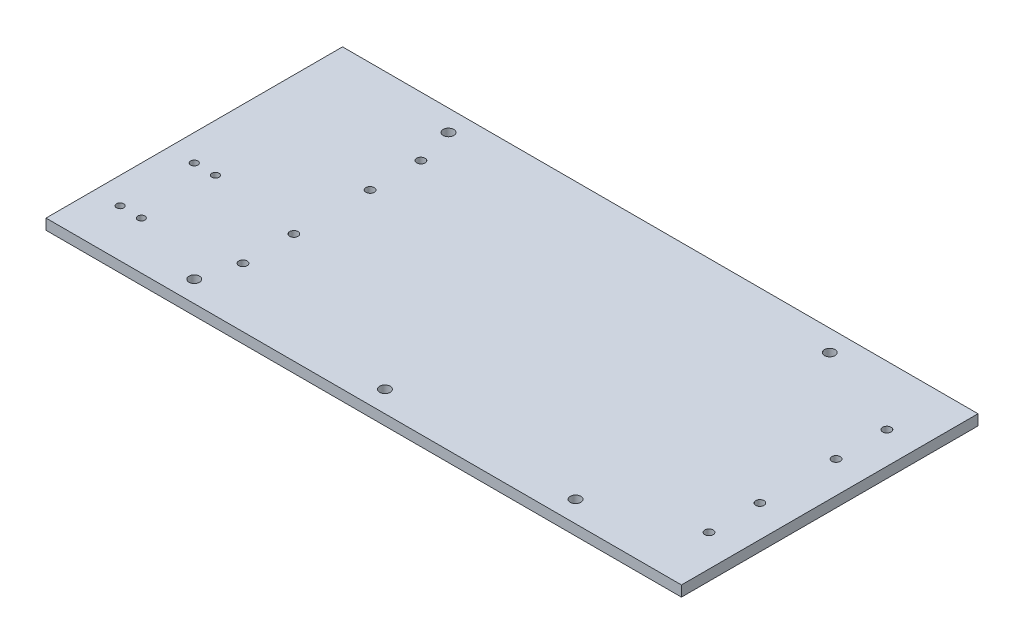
ISO-10303-21;
HEADER;
FILE_DESCRIPTION(('STEP AP214'),'2;1');
FILE_NAME('part.step','',(''),(''),'','','');
FILE_SCHEMA(('AUTOMOTIVE_DESIGN { 1 0 10303 214 1 1 1 1 }'));
ENDSEC;
DATA;
#1=APPLICATION_CONTEXT('core data for automotive mechanical design processes');
#2=APPLICATION_PROTOCOL_DEFINITION('international standard','automotive_design',2000,#1);
#3=PRODUCT_CONTEXT('',#1,'mechanical');
#4=PRODUCT('Part','Part','',(#3));
#5=PRODUCT_RELATED_PRODUCT_CATEGORY('part','',(#4));
#6=PRODUCT_DEFINITION_FORMATION('','',#4);
#7=PRODUCT_DEFINITION_CONTEXT('part definition',#1,'design');
#8=PRODUCT_DEFINITION('design','',#6,#7);
#9=PRODUCT_DEFINITION_SHAPE('','',#8);
#10=(LENGTH_UNIT() NAMED_UNIT(*) SI_UNIT(.MILLI.,.METRE.));
#11=(NAMED_UNIT(*) PLANE_ANGLE_UNIT() SI_UNIT($,.RADIAN.));
#12=(NAMED_UNIT(*) SI_UNIT($,.STERADIAN.) SOLID_ANGLE_UNIT());
#13=UNCERTAINTY_MEASURE_WITH_UNIT(LENGTH_MEASURE(1.E-05),#10,'distance_accuracy_value','');
#14=(GEOMETRIC_REPRESENTATION_CONTEXT(3) GLOBAL_UNCERTAINTY_ASSIGNED_CONTEXT((#13)) GLOBAL_UNIT_ASSIGNED_CONTEXT((#10,
#11,#12)) REPRESENTATION_CONTEXT('',''));
#15=CARTESIAN_POINT('',(0.,0.,0.));
#16=DIRECTION('',(0.,0.,1.));
#17=DIRECTION('',(1.,0.,0.));
#18=AXIS2_PLACEMENT_3D('',#15,#16,#17);
#19=CARTESIAN_POINT('',(-190.5,6.35,88.9));
#20=DIRECTION('',(1.,0.,0.));
#21=DIRECTION('',(0.,0.,-1.));
#22=AXIS2_PLACEMENT_3D('',#19,#20,#21);
#23=PLANE('',#22);
#24=DIRECTION('',(0.,0.,1.));
#25=VECTOR('',#24,1.);
#26=CARTESIAN_POINT('',(-190.5,0.,88.9));
#27=LINE('',#26,#25);
#28=CARTESIAN_POINT('',(-190.5,0.,-88.9));
#29=VERTEX_POINT('',#28);
#30=CARTESIAN_POINT('',(-190.5,0.,88.9));
#31=VERTEX_POINT('',#30);
#32=EDGE_CURVE('E106',#29,#31,#27,.T.);
#33=ORIENTED_EDGE('',*,*,#32,.T.);
#34=DIRECTION('',(0.,-1.,0.));
#35=VECTOR('',#34,1.);
#36=CARTESIAN_POINT('',(-190.5,6.35,88.9));
#37=LINE('',#36,#35);
#38=CARTESIAN_POINT('',(-190.5,6.35,88.9));
#39=VERTEX_POINT('',#38);
#40=EDGE_CURVE('E11',#39,#31,#37,.T.);
#41=ORIENTED_EDGE('',*,*,#40,.F.);
#42=DIRECTION('',(0.,0.,1.));
#43=VECTOR('',#42,1.);
#44=CARTESIAN_POINT('',(-190.5,6.35,88.9));
#45=LINE('',#44,#43);
#46=CARTESIAN_POINT('',(-190.5,6.35,-88.9));
#47=VERTEX_POINT('',#46);
#48=EDGE_CURVE('E90',#47,#39,#45,.T.);
#49=ORIENTED_EDGE('',*,*,#48,.F.);
#50=DIRECTION('',(0.,-1.,0.));
#51=VECTOR('',#50,1.);
#52=CARTESIAN_POINT('',(-190.5,6.35,-88.9));
#53=LINE('',#52,#51);
#54=EDGE_CURVE('E102',#47,#29,#53,.T.);
#55=ORIENTED_EDGE('',*,*,#54,.T.);
#56=EDGE_LOOP('',(#33,#41,#49,#55));
#57=FACE_BOUND('',#56,.T.);
#58=ADVANCED_FACE('F38',(#57),#23,.F.);
#59=CARTESIAN_POINT('',(-190.5,6.35,88.9));
#60=DIRECTION('',(0.,0.,-1.));
#61=DIRECTION('',(-1.,0.,0.));
#62=AXIS2_PLACEMENT_3D('',#59,#60,#61);
#63=PLANE('',#62);
#64=DIRECTION('',(1.,0.,0.));
#65=VECTOR('',#64,1.);
#66=CARTESIAN_POINT('',(-190.5,0.,88.9));
#67=LINE('',#66,#65);
#68=CARTESIAN_POINT('',(190.5,0.,88.9));
#69=VERTEX_POINT('',#68);
#70=EDGE_CURVE('E95',#31,#69,#67,.T.);
#71=ORIENTED_EDGE('',*,*,#70,.T.);
#72=DIRECTION('',(0.,-1.,0.));
#73=VECTOR('',#72,1.);
#74=CARTESIAN_POINT('',(190.5,6.35,88.9));
#75=LINE('',#74,#73);
#76=CARTESIAN_POINT('',(190.5,6.35,88.9));
#77=VERTEX_POINT('',#76);
#78=EDGE_CURVE('E47',#77,#69,#75,.T.);
#79=ORIENTED_EDGE('',*,*,#78,.F.);
#80=DIRECTION('',(1.,0.,0.));
#81=VECTOR('',#80,1.);
#82=CARTESIAN_POINT('',(-190.5,6.35,88.9));
#83=LINE('',#82,#81);
#84=EDGE_CURVE('E85',#39,#77,#83,.T.);
#85=ORIENTED_EDGE('',*,*,#84,.F.);
#86=ORIENTED_EDGE('',*,*,#40,.T.);
#87=EDGE_LOOP('',(#71,#79,#85,#86));
#88=FACE_BOUND('',#87,.T.);
#89=ADVANCED_FACE('F94',(#88),#63,.F.);
#90=CARTESIAN_POINT('',(190.5,6.35,88.9));
#91=DIRECTION('',(-1.,0.,0.));
#92=DIRECTION('',(0.,0.,1.));
#93=AXIS2_PLACEMENT_3D('',#90,#91,#92);
#94=PLANE('',#93);
#95=DIRECTION('',(0.,0.,-1.));
#96=VECTOR('',#95,1.);
#97=CARTESIAN_POINT('',(190.5,0.,88.9));
#98=LINE('',#97,#96);
#99=CARTESIAN_POINT('',(190.5,0.,-88.9));
#100=VERTEX_POINT('',#99);
#101=EDGE_CURVE('E72',#69,#100,#98,.T.);
#102=ORIENTED_EDGE('',*,*,#101,.T.);
#103=DIRECTION('',(0.,-1.,0.));
#104=VECTOR('',#103,1.);
#105=CARTESIAN_POINT('',(190.5,6.35,-88.9));
#106=LINE('',#105,#104);
#107=CARTESIAN_POINT('',(190.5,6.35,-88.9));
#108=VERTEX_POINT('',#107);
#109=EDGE_CURVE('E97',#108,#100,#106,.T.);
#110=ORIENTED_EDGE('',*,*,#109,.F.);
#111=DIRECTION('',(0.,0.,-1.));
#112=VECTOR('',#111,1.);
#113=CARTESIAN_POINT('',(190.5,6.35,88.9));
#114=LINE('',#113,#112);
#115=EDGE_CURVE('E88',#77,#108,#114,.T.);
#116=ORIENTED_EDGE('',*,*,#115,.F.);
#117=ORIENTED_EDGE('',*,*,#78,.T.);
#118=EDGE_LOOP('',(#102,#110,#116,#117));
#119=FACE_BOUND('',#118,.T.);
#120=ADVANCED_FACE('F98',(#119),#94,.F.);
#121=CARTESIAN_POINT('',(-190.5,6.35,-88.9));
#122=DIRECTION('',(0.,0.,1.));
#123=DIRECTION('',(1.,0.,0.));
#124=AXIS2_PLACEMENT_3D('',#121,#122,#123);
#125=PLANE('',#124);
#126=DIRECTION('',(-1.,0.,0.));
#127=VECTOR('',#126,1.);
#128=CARTESIAN_POINT('',(-190.5,0.,-88.9));
#129=LINE('',#128,#127);
#130=EDGE_CURVE('E78',#100,#29,#129,.T.);
#131=ORIENTED_EDGE('',*,*,#130,.T.);
#132=ORIENTED_EDGE('',*,*,#54,.F.);
#133=DIRECTION('',(-1.,0.,0.));
#134=VECTOR('',#133,1.);
#135=CARTESIAN_POINT('',(-190.5,6.35,-88.9));
#136=LINE('',#135,#134);
#137=EDGE_CURVE('E55',#108,#47,#136,.T.);
#138=ORIENTED_EDGE('',*,*,#137,.F.);
#139=ORIENTED_EDGE('',*,*,#109,.T.);
#140=EDGE_LOOP('',(#131,#132,#138,#139));
#141=FACE_BOUND('',#140,.T.);
#142=ADVANCED_FACE('F120',(#141),#125,.F.);
#143=CARTESIAN_POINT('',(0.,6.35,0.));
#144=DIRECTION('',(0.,-1.,0.));
#145=DIRECTION('',(0.,0.,-1.));
#146=AXIS2_PLACEMENT_3D('',#143,#144,#145);
#147=PLANE('',#146);
#148=CARTESIAN_POINT('',(-161.925,6.35,60.325));
#149=DIRECTION('',(0.,-1.,0.));
#150=DIRECTION('',(0.,0.,-1.));
#151=AXIS2_PLACEMENT_3D('',#148,#149,#150);
#152=CIRCLE('',#151,2.15265000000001);
#153=CARTESIAN_POINT('',(-161.925,6.35,58.17235));
#154=VERTEX_POINT('',#153);
#155=EDGE_CURVE('E238',#154,#154,#152,.F.);
#156=ORIENTED_EDGE('',*,*,#155,.F.);
#157=EDGE_LOOP('',(#156));
#158=FACE_BOUND('',#157,.T.);
#159=CARTESIAN_POINT('',(-174.625,6.35,15.875));
#160=DIRECTION('',(0.,-1.,0.));
#161=DIRECTION('',(0.,0.,-1.));
#162=AXIS2_PLACEMENT_3D('',#159,#160,#161);
#163=CIRCLE('',#162,2.15265000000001);
#164=CARTESIAN_POINT('',(-174.625,6.35,13.72235));
#165=VERTEX_POINT('',#164);
#166=EDGE_CURVE('E239',#165,#165,#163,.F.);
#167=ORIENTED_EDGE('',*,*,#166,.F.);
#168=EDGE_LOOP('',(#167));
#169=FACE_BOUND('',#168,.T.);
#170=CARTESIAN_POINT('',(-161.925,6.35,15.875));
#171=DIRECTION('',(0.,-1.,0.));
#172=DIRECTION('',(0.,0.,-1.));
#173=AXIS2_PLACEMENT_3D('',#170,#171,#172);
#174=CIRCLE('',#173,2.15265000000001);
#175=CARTESIAN_POINT('',(-161.925,6.35,13.72235));
#176=VERTEX_POINT('',#175);
#177=EDGE_CURVE('E248',#176,#176,#174,.F.);
#178=ORIENTED_EDGE('',*,*,#177,.F.);
#179=EDGE_LOOP('',(#178));
#180=FACE_BOUND('',#179,.T.);
#181=CARTESIAN_POINT('',(-174.625,6.35,60.325));
#182=DIRECTION('',(0.,-1.,0.));
#183=DIRECTION('',(0.,0.,-1.));
#184=AXIS2_PLACEMENT_3D('',#181,#182,#183);
#185=CIRCLE('',#184,2.15265000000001);
#186=CARTESIAN_POINT('',(-174.625,6.35,58.17235));
#187=VERTEX_POINT('',#186);
#188=EDGE_CURVE('E216',#187,#187,#185,.F.);
#189=ORIENTED_EDGE('',*,*,#188,.F.);
#190=EDGE_LOOP('',(#189));
#191=FACE_BOUND('',#190,.T.);
#192=CARTESIAN_POINT('',(-107.95,6.35,-22.86));
#193=DIRECTION('',(0.,-1.,0.));
#194=DIRECTION('',(0.,0.,-1.));
#195=AXIS2_PLACEMENT_3D('',#192,#193,#194);
#196=CIRCLE('',#195,2.5019);
#197=CARTESIAN_POINT('',(-107.95,6.35,-25.3619));
#198=VERTEX_POINT('',#197);
#199=EDGE_CURVE('E191',#198,#198,#196,.F.);
#200=ORIENTED_EDGE('',*,*,#199,.F.);
#201=EDGE_LOOP('',(#200));
#202=FACE_BOUND('',#201,.T.);
#203=CARTESIAN_POINT('',(171.45,6.35,-22.86));
#204=DIRECTION('',(0.,-1.,0.));
#205=DIRECTION('',(0.,0.,-1.));
#206=AXIS2_PLACEMENT_3D('',#203,#204,#205);
#207=CIRCLE('',#206,2.5019);
#208=CARTESIAN_POINT('',(171.45,6.35,-25.3619));
#209=VERTEX_POINT('',#208);
#210=EDGE_CURVE('E184',#209,#209,#207,.F.);
#211=ORIENTED_EDGE('',*,*,#210,.F.);
#212=EDGE_LOOP('',(#211));
#213=FACE_BOUND('',#212,.T.);
#214=CARTESIAN_POINT('',(171.45,6.35,-53.34));
#215=DIRECTION('',(0.,-1.,0.));
#216=DIRECTION('',(0.,0.,-1.));
#217=AXIS2_PLACEMENT_3D('',#214,#215,#216);
#218=CIRCLE('',#217,2.50190000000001);
#219=CARTESIAN_POINT('',(171.45,6.35,-55.8419));
#220=VERTEX_POINT('',#219);
#221=EDGE_CURVE('E175',#220,#220,#218,.F.);
#222=ORIENTED_EDGE('',*,*,#221,.F.);
#223=EDGE_LOOP('',(#222));
#224=FACE_BOUND('',#223,.T.);
#225=CARTESIAN_POINT('',(171.45,6.35,53.34));
#226=DIRECTION('',(0.,-1.,0.));
#227=DIRECTION('',(0.,0.,-1.));
#228=AXIS2_PLACEMENT_3D('',#225,#226,#227);
#229=CIRCLE('',#228,2.50190000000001);
#230=CARTESIAN_POINT('',(171.45,6.35,50.8381));
#231=VERTEX_POINT('',#230);
#232=EDGE_CURVE('E174',#231,#231,#229,.F.);
#233=ORIENTED_EDGE('',*,*,#232,.F.);
#234=EDGE_LOOP('',(#233));
#235=FACE_BOUND('',#234,.T.);
#236=CARTESIAN_POINT('',(-107.95,6.35,-53.34));
#237=DIRECTION('',(0.,-1.,0.));
#238=DIRECTION('',(0.,0.,-1.));
#239=AXIS2_PLACEMENT_3D('',#236,#237,#238);
#240=CIRCLE('',#239,2.50190000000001);
#241=CARTESIAN_POINT('',(-107.95,6.35,-55.8419));
#242=VERTEX_POINT('',#241);
#243=EDGE_CURVE('E200',#242,#242,#240,.F.);
#244=ORIENTED_EDGE('',*,*,#243,.F.);
#245=EDGE_LOOP('',(#244));
#246=FACE_BOUND('',#245,.T.);
#247=CARTESIAN_POINT('',(171.45,6.35,22.86));
#248=DIRECTION('',(0.,-1.,0.));
#249=DIRECTION('',(0.,0.,-1.));
#250=AXIS2_PLACEMENT_3D('',#247,#248,#249);
#251=CIRCLE('',#250,2.5019);
#252=CARTESIAN_POINT('',(171.45,6.35,20.3581));
#253=VERTEX_POINT('',#252);
#254=EDGE_CURVE('E217',#253,#253,#251,.F.);
#255=ORIENTED_EDGE('',*,*,#254,.F.);
#256=EDGE_LOOP('',(#255));
#257=FACE_BOUND('',#256,.T.);
#258=CARTESIAN_POINT('',(-107.95,6.35,53.34));
#259=DIRECTION('',(0.,-1.,0.));
#260=DIRECTION('',(0.,0.,-1.));
#261=AXIS2_PLACEMENT_3D('',#258,#259,#260);
#262=CIRCLE('',#261,2.50190000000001);
#263=CARTESIAN_POINT('',(-107.95,6.35,50.8381));
#264=VERTEX_POINT('',#263);
#265=EDGE_CURVE('E207',#264,#264,#262,.F.);
#266=ORIENTED_EDGE('',*,*,#265,.F.);
#267=EDGE_LOOP('',(#266));
#268=FACE_BOUND('',#267,.T.);
#269=CARTESIAN_POINT('',(-107.95,6.35,22.86));
#270=DIRECTION('',(0.,-1.,0.));
#271=DIRECTION('',(0.,0.,-1.));
#272=AXIS2_PLACEMENT_3D('',#269,#270,#271);
#273=CIRCLE('',#272,2.5019);
#274=CARTESIAN_POINT('',(-107.95,6.35,20.3581));
#275=VERTEX_POINT('',#274);
#276=EDGE_CURVE('E144',#275,#275,#273,.F.);
#277=ORIENTED_EDGE('',*,*,#276,.F.);
#278=EDGE_LOOP('',(#277));
#279=FACE_BOUND('',#278,.T.);
#280=CARTESIAN_POINT('',(114.3,6.35,-76.2));
#281=DIRECTION('',(0.,-1.,0.));
#282=DIRECTION('',(0.,0.,-1.));
#283=AXIS2_PLACEMENT_3D('',#280,#281,#282);
#284=CIRCLE('',#283,3.175);
#285=CARTESIAN_POINT('',(114.3,6.35,-79.375));
#286=VERTEX_POINT('',#285);
#287=EDGE_CURVE('E135',#286,#286,#284,.F.);
#288=ORIENTED_EDGE('',*,*,#287,.F.);
#289=EDGE_LOOP('',(#288));
#290=FACE_BOUND('',#289,.T.);
#291=CARTESIAN_POINT('',(-114.3,6.35,-76.2));
#292=DIRECTION('',(0.,-1.,0.));
#293=DIRECTION('',(0.,0.,-1.));
#294=AXIS2_PLACEMENT_3D('',#291,#292,#293);
#295=CIRCLE('',#294,3.175);
#296=CARTESIAN_POINT('',(-114.3,6.35,-79.375));
#297=VERTEX_POINT('',#296);
#298=EDGE_CURVE('E145',#297,#297,#295,.F.);
#299=ORIENTED_EDGE('',*,*,#298,.F.);
#300=EDGE_LOOP('',(#299));
#301=FACE_BOUND('',#300,.T.);
#302=CARTESIAN_POINT('',(114.3,6.35,76.2));
#303=DIRECTION('',(0.,-1.,0.));
#304=DIRECTION('',(0.,0.,-1.));
#305=AXIS2_PLACEMENT_3D('',#302,#303,#304);
#306=CIRCLE('',#305,3.175);
#307=CARTESIAN_POINT('',(114.3,6.35,73.025));
#308=VERTEX_POINT('',#307);
#309=EDGE_CURVE('E153',#308,#308,#306,.F.);
#310=ORIENTED_EDGE('',*,*,#309,.F.);
#311=EDGE_LOOP('',(#310));
#312=FACE_BOUND('',#311,.T.);
#313=CARTESIAN_POINT('',(-114.3,6.35,76.2));
#314=DIRECTION('',(0.,-1.,0.));
#315=DIRECTION('',(0.,0.,-1.));
#316=AXIS2_PLACEMENT_3D('',#313,#314,#315);
#317=CIRCLE('',#316,3.175);
#318=CARTESIAN_POINT('',(-114.3,6.35,73.025));
#319=VERTEX_POINT('',#318);
#320=EDGE_CURVE('E134',#319,#319,#317,.F.);
#321=ORIENTED_EDGE('',*,*,#320,.F.);
#322=EDGE_LOOP('',(#321));
#323=FACE_BOUND('',#322,.T.);
#324=CARTESIAN_POINT('',(0.,6.35,76.2));
#325=DIRECTION('',(0.,-1.,0.));
#326=DIRECTION('',(0.,0.,-1.));
#327=AXIS2_PLACEMENT_3D('',#324,#325,#326);
#328=CIRCLE('',#327,3.175);
#329=CARTESIAN_POINT('',(0.,6.35,73.025));
#330=VERTEX_POINT('',#329);
#331=EDGE_CURVE('E110',#330,#330,#328,.F.);
#332=ORIENTED_EDGE('',*,*,#331,.F.);
#333=EDGE_LOOP('',(#332));
#334=FACE_BOUND('',#333,.T.);
#335=ORIENTED_EDGE('',*,*,#48,.T.);
#336=ORIENTED_EDGE('',*,*,#84,.T.);
#337=ORIENTED_EDGE('',*,*,#115,.T.);
#338=ORIENTED_EDGE('',*,*,#137,.T.);
#339=EDGE_LOOP('',(#335,#336,#337,#338));
#340=FACE_BOUND('',#339,.T.);
#341=ADVANCED_FACE('F86',(#158,#169,#180,#191,#202,#213,#224,#235,#246,#257,#268,#279,#290,#301,
#312,#323,#334,#340),#147,.F.);
#342=CARTESIAN_POINT('',(0.,0.,0.));
#343=DIRECTION('',(0.,-1.,0.));
#344=DIRECTION('',(0.,0.,-1.));
#345=AXIS2_PLACEMENT_3D('',#342,#343,#344);
#346=PLANE('',#345);
#347=CARTESIAN_POINT('',(-161.925,0.,60.325));
#348=DIRECTION('',(0.,-1.,0.));
#349=DIRECTION('',(0.,0.,-1.));
#350=AXIS2_PLACEMENT_3D('',#347,#348,#349);
#351=CIRCLE('',#350,2.15265000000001);
#352=CARTESIAN_POINT('',(-161.925,0.,58.17235));
#353=VERTEX_POINT('',#352);
#354=EDGE_CURVE('E243',#353,#353,#351,.T.);
#355=ORIENTED_EDGE('',*,*,#354,.F.);
#356=EDGE_LOOP('',(#355));
#357=FACE_BOUND('',#356,.T.);
#358=CARTESIAN_POINT('',(-174.625,0.,15.875));
#359=DIRECTION('',(0.,-1.,0.));
#360=DIRECTION('',(0.,0.,-1.));
#361=AXIS2_PLACEMENT_3D('',#358,#359,#360);
#362=CIRCLE('',#361,2.15265000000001);
#363=CARTESIAN_POINT('',(-174.625,0.,13.72235));
#364=VERTEX_POINT('',#363);
#365=EDGE_CURVE('E244',#364,#364,#362,.T.);
#366=ORIENTED_EDGE('',*,*,#365,.F.);
#367=EDGE_LOOP('',(#366));
#368=FACE_BOUND('',#367,.T.);
#369=CARTESIAN_POINT('',(-161.925,0.,15.875));
#370=DIRECTION('',(0.,-1.,0.));
#371=DIRECTION('',(0.,0.,-1.));
#372=AXIS2_PLACEMENT_3D('',#369,#370,#371);
#373=CIRCLE('',#372,2.15265000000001);
#374=CARTESIAN_POINT('',(-161.925,0.,13.72235));
#375=VERTEX_POINT('',#374);
#376=EDGE_CURVE('E258',#375,#375,#373,.T.);
#377=ORIENTED_EDGE('',*,*,#376,.F.);
#378=EDGE_LOOP('',(#377));
#379=FACE_BOUND('',#378,.T.);
#380=CARTESIAN_POINT('',(-174.625,0.,60.325));
#381=DIRECTION('',(0.,-1.,0.));
#382=DIRECTION('',(0.,0.,-1.));
#383=AXIS2_PLACEMENT_3D('',#380,#381,#382);
#384=CIRCLE('',#383,2.15265000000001);
#385=CARTESIAN_POINT('',(-174.625,0.,58.17235));
#386=VERTEX_POINT('',#385);
#387=EDGE_CURVE('E234',#386,#386,#384,.T.);
#388=ORIENTED_EDGE('',*,*,#387,.F.);
#389=EDGE_LOOP('',(#388));
#390=FACE_BOUND('',#389,.T.);
#391=CARTESIAN_POINT('',(-107.95,0.,-22.86));
#392=DIRECTION('',(0.,-1.,0.));
#393=DIRECTION('',(0.,0.,1.));
#394=AXIS2_PLACEMENT_3D('',#391,#392,#393);
#395=CIRCLE('',#394,2.5019);
#396=CARTESIAN_POINT('',(-107.95,0.,-20.3581));
#397=VERTEX_POINT('',#396);
#398=EDGE_CURVE('E196',#397,#397,#395,.T.);
#399=ORIENTED_EDGE('',*,*,#398,.F.);
#400=EDGE_LOOP('',(#399));
#401=FACE_BOUND('',#400,.T.);
#402=CARTESIAN_POINT('',(171.45,0.,-22.86));
#403=DIRECTION('',(0.,-1.,0.));
#404=DIRECTION('',(0.,0.,1.));
#405=AXIS2_PLACEMENT_3D('',#402,#403,#404);
#406=CIRCLE('',#405,2.5019);
#407=CARTESIAN_POINT('',(171.45,0.,-20.3581));
#408=VERTEX_POINT('',#407);
#409=EDGE_CURVE('E195',#408,#408,#406,.T.);
#410=ORIENTED_EDGE('',*,*,#409,.F.);
#411=EDGE_LOOP('',(#410));
#412=FACE_BOUND('',#411,.T.);
#413=CARTESIAN_POINT('',(171.45,0.,-53.34));
#414=DIRECTION('',(0.,-1.,0.));
#415=DIRECTION('',(0.,0.,1.));
#416=AXIS2_PLACEMENT_3D('',#413,#414,#415);
#417=CIRCLE('',#416,2.50190000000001);
#418=CARTESIAN_POINT('',(171.45,0.,-50.8381));
#419=VERTEX_POINT('',#418);
#420=EDGE_CURVE('E180',#419,#419,#417,.T.);
#421=ORIENTED_EDGE('',*,*,#420,.F.);
#422=EDGE_LOOP('',(#421));
#423=FACE_BOUND('',#422,.T.);
#424=CARTESIAN_POINT('',(171.45,0.,53.34));
#425=DIRECTION('',(0.,-1.,0.));
#426=DIRECTION('',(0.,0.,-1.));
#427=AXIS2_PLACEMENT_3D('',#424,#425,#426);
#428=CIRCLE('',#427,2.50190000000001);
#429=CARTESIAN_POINT('',(171.45,0.,50.8381));
#430=VERTEX_POINT('',#429);
#431=EDGE_CURVE('E179',#430,#430,#428,.T.);
#432=ORIENTED_EDGE('',*,*,#431,.F.);
#433=EDGE_LOOP('',(#432));
#434=FACE_BOUND('',#433,.T.);
#435=CARTESIAN_POINT('',(-107.95,0.,-53.34));
#436=DIRECTION('',(0.,-1.,0.));
#437=DIRECTION('',(0.,0.,-1.));
#438=AXIS2_PLACEMENT_3D('',#435,#436,#437);
#439=CIRCLE('',#438,2.50190000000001);
#440=CARTESIAN_POINT('',(-107.95,0.,-55.8419));
#441=VERTEX_POINT('',#440);
#442=EDGE_CURVE('E221',#441,#441,#439,.T.);
#443=ORIENTED_EDGE('',*,*,#442,.F.);
#444=EDGE_LOOP('',(#443));
#445=FACE_BOUND('',#444,.T.);
#446=CARTESIAN_POINT('',(171.45,0.,22.86));
#447=DIRECTION('',(0.,-1.,0.));
#448=DIRECTION('',(0.,0.,-1.));
#449=AXIS2_PLACEMENT_3D('',#446,#447,#448);
#450=CIRCLE('',#449,2.5019);
#451=CARTESIAN_POINT('',(171.45,0.,20.3581));
#452=VERTEX_POINT('',#451);
#453=EDGE_CURVE('E211',#452,#452,#450,.T.);
#454=ORIENTED_EDGE('',*,*,#453,.F.);
#455=EDGE_LOOP('',(#454));
#456=FACE_BOUND('',#455,.T.);
#457=CARTESIAN_POINT('',(-107.95,0.,53.34));
#458=DIRECTION('',(0.,-1.,0.));
#459=DIRECTION('',(0.,0.,1.));
#460=AXIS2_PLACEMENT_3D('',#457,#458,#459);
#461=CIRCLE('',#460,2.50190000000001);
#462=CARTESIAN_POINT('',(-107.95,0.,55.8419));
#463=VERTEX_POINT('',#462);
#464=EDGE_CURVE('E212',#463,#463,#461,.T.);
#465=ORIENTED_EDGE('',*,*,#464,.F.);
#466=EDGE_LOOP('',(#465));
#467=FACE_BOUND('',#466,.T.);
#468=CARTESIAN_POINT('',(-107.95,0.,22.86));
#469=DIRECTION('',(0.,-1.,0.));
#470=DIRECTION('',(0.,0.,-1.));
#471=AXIS2_PLACEMENT_3D('',#468,#469,#470);
#472=CIRCLE('',#471,2.5019);
#473=CARTESIAN_POINT('',(-107.95,0.,20.3581));
#474=VERTEX_POINT('',#473);
#475=EDGE_CURVE('E170',#474,#474,#472,.T.);
#476=ORIENTED_EDGE('',*,*,#475,.F.);
#477=EDGE_LOOP('',(#476));
#478=FACE_BOUND('',#477,.T.);
#479=CARTESIAN_POINT('',(114.3,0.,-76.2));
#480=DIRECTION('',(0.,-1.,0.));
#481=DIRECTION('',(0.,0.,-1.));
#482=AXIS2_PLACEMENT_3D('',#479,#480,#481);
#483=CIRCLE('',#482,3.175);
#484=CARTESIAN_POINT('',(114.3,0.,-79.375));
#485=VERTEX_POINT('',#484);
#486=EDGE_CURVE('E140',#485,#485,#483,.T.);
#487=ORIENTED_EDGE('',*,*,#486,.F.);
#488=EDGE_LOOP('',(#487));
#489=FACE_BOUND('',#488,.T.);
#490=CARTESIAN_POINT('',(-114.3,0.,-76.2));
#491=DIRECTION('',(0.,-1.,0.));
#492=DIRECTION('',(0.,0.,-1.));
#493=AXIS2_PLACEMENT_3D('',#490,#491,#492);
#494=CIRCLE('',#493,3.175);
#495=CARTESIAN_POINT('',(-114.3,0.,-79.375));
#496=VERTEX_POINT('',#495);
#497=EDGE_CURVE('E139',#496,#496,#494,.T.);
#498=ORIENTED_EDGE('',*,*,#497,.F.);
#499=EDGE_LOOP('',(#498));
#500=FACE_BOUND('',#499,.T.);
#501=CARTESIAN_POINT('',(114.3,0.,76.2));
#502=DIRECTION('',(0.,-1.,0.));
#503=DIRECTION('',(0.,0.,-1.));
#504=AXIS2_PLACEMENT_3D('',#501,#502,#503);
#505=CIRCLE('',#504,3.175);
#506=CARTESIAN_POINT('',(114.3,0.,73.025));
#507=VERTEX_POINT('',#506);
#508=EDGE_CURVE('E149',#507,#507,#505,.T.);
#509=ORIENTED_EDGE('',*,*,#508,.F.);
#510=EDGE_LOOP('',(#509));
#511=FACE_BOUND('',#510,.T.);
#512=CARTESIAN_POINT('',(-114.3,0.,76.2));
#513=DIRECTION('',(0.,-1.,0.));
#514=DIRECTION('',(0.,0.,-1.));
#515=AXIS2_PLACEMENT_3D('',#512,#513,#514);
#516=CIRCLE('',#515,3.175);
#517=CARTESIAN_POINT('',(-114.3,0.,73.025));
#518=VERTEX_POINT('',#517);
#519=EDGE_CURVE('E157',#518,#518,#516,.T.);
#520=ORIENTED_EDGE('',*,*,#519,.F.);
#521=EDGE_LOOP('',(#520));
#522=FACE_BOUND('',#521,.T.);
#523=CARTESIAN_POINT('',(0.,0.,76.2));
#524=DIRECTION('',(0.,-1.,0.));
#525=DIRECTION('',(0.,0.,-1.));
#526=AXIS2_PLACEMENT_3D('',#523,#524,#525);
#527=CIRCLE('',#526,3.175);
#528=CARTESIAN_POINT('',(0.,0.,73.025));
#529=VERTEX_POINT('',#528);
#530=EDGE_CURVE('E130',#529,#529,#527,.T.);
#531=ORIENTED_EDGE('',*,*,#530,.F.);
#532=EDGE_LOOP('',(#531));
#533=FACE_BOUND('',#532,.T.);
#534=ORIENTED_EDGE('',*,*,#32,.F.);
#535=ORIENTED_EDGE('',*,*,#130,.F.);
#536=ORIENTED_EDGE('',*,*,#101,.F.);
#537=ORIENTED_EDGE('',*,*,#70,.F.);
#538=EDGE_LOOP('',(#534,#535,#536,#537));
#539=FACE_BOUND('',#538,.T.);
#540=ADVANCED_FACE('F123',(#357,#368,#379,#390,#401,#412,#423,#434,#445,#456,#467,#478,#489,
#500,#511,#522,#533,#539),#346,.T.);
#541=CARTESIAN_POINT('',(0.,15.3302561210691,76.2));
#542=DIRECTION('',(0.,-1.,0.));
#543=DIRECTION('',(0.,0.,-1.));
#544=AXIS2_PLACEMENT_3D('',#541,#542,#543);
#545=CYLINDRICAL_SURFACE('',#544,3.175);
#546=CARTESIAN_POINT('',(0.,6.35,73.025));
#547=CARTESIAN_POINT('',(0.,6.28385416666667,73.025));
#548=CARTESIAN_POINT('',(0.,6.21770833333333,73.025));
#549=CARTESIAN_POINT('',(0.,6.08541666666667,73.025));
#550=CARTESIAN_POINT('',(0.,6.01927083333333,73.025));
#551=CARTESIAN_POINT('',(0.,5.88697916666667,73.025));
#552=CARTESIAN_POINT('',(0.,5.82083333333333,73.025));
#553=CARTESIAN_POINT('',(0.,5.68854166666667,73.025));
#554=CARTESIAN_POINT('',(0.,5.62239583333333,73.025));
#555=CARTESIAN_POINT('',(0.,5.49010416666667,73.025));
#556=CARTESIAN_POINT('',(0.,5.42395833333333,73.025));
#557=CARTESIAN_POINT('',(0.,5.29166666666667,73.025));
#558=CARTESIAN_POINT('',(0.,5.22552083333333,73.025));
#559=CARTESIAN_POINT('',(0.,5.09322916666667,73.025));
#560=CARTESIAN_POINT('',(0.,5.02708333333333,73.025));
#561=CARTESIAN_POINT('',(0.,4.89479166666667,73.025));
#562=CARTESIAN_POINT('',(0.,4.82864583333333,73.025));
#563=CARTESIAN_POINT('',(0.,4.69635416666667,73.025));
#564=CARTESIAN_POINT('',(0.,4.63020833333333,73.025));
#565=CARTESIAN_POINT('',(0.,4.49791666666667,73.025));
#566=CARTESIAN_POINT('',(0.,4.43177083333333,73.025));
#567=CARTESIAN_POINT('',(0.,4.29947916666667,73.025));
#568=CARTESIAN_POINT('',(0.,4.23333333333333,73.025));
#569=CARTESIAN_POINT('',(0.,4.10104166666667,73.025));
#570=CARTESIAN_POINT('',(0.,4.03489583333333,73.025));
#571=CARTESIAN_POINT('',(0.,3.90260416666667,73.025));
#572=CARTESIAN_POINT('',(0.,3.83645833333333,73.025));
#573=CARTESIAN_POINT('',(0.,3.70416666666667,73.025));
#574=CARTESIAN_POINT('',(0.,3.63802083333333,73.025));
#575=CARTESIAN_POINT('',(0.,3.50572916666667,73.025));
#576=CARTESIAN_POINT('',(0.,3.43958333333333,73.025));
#577=CARTESIAN_POINT('',(0.,3.30729166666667,73.025));
#578=CARTESIAN_POINT('',(0.,3.24114583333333,73.025));
#579=CARTESIAN_POINT('',(0.,3.10885416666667,73.025));
#580=CARTESIAN_POINT('',(0.,3.04270833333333,73.025));
#581=CARTESIAN_POINT('',(0.,2.91041666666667,73.025));
#582=CARTESIAN_POINT('',(0.,2.84427083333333,73.025));
#583=CARTESIAN_POINT('',(0.,2.71197916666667,73.025));
#584=CARTESIAN_POINT('',(0.,2.64583333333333,73.025));
#585=CARTESIAN_POINT('',(0.,2.51354166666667,73.025));
#586=CARTESIAN_POINT('',(0.,2.44739583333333,73.025));
#587=CARTESIAN_POINT('',(0.,2.31510416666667,73.025));
#588=CARTESIAN_POINT('',(0.,2.24895833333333,73.025));
#589=CARTESIAN_POINT('',(0.,2.11666666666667,73.025));
#590=CARTESIAN_POINT('',(0.,2.05052083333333,73.025));
#591=CARTESIAN_POINT('',(0.,1.91822916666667,73.025));
#592=CARTESIAN_POINT('',(0.,1.85208333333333,73.025));
#593=CARTESIAN_POINT('',(0.,1.71979166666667,73.025));
#594=CARTESIAN_POINT('',(0.,1.65364583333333,73.025));
#595=CARTESIAN_POINT('',(0.,1.52135416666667,73.025));
#596=CARTESIAN_POINT('',(0.,1.45520833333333,73.025));
#597=CARTESIAN_POINT('',(0.,1.32291666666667,73.025));
#598=CARTESIAN_POINT('',(0.,1.25677083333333,73.025));
#599=CARTESIAN_POINT('',(0.,1.12447916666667,73.025));
#600=CARTESIAN_POINT('',(0.,1.05833333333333,73.025));
#601=CARTESIAN_POINT('',(0.,0.926041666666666,73.025));
#602=CARTESIAN_POINT('',(0.,0.859895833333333,73.025));
#603=CARTESIAN_POINT('',(0.,0.727604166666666,73.025));
#604=CARTESIAN_POINT('',(0.,0.661458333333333,73.025));
#605=CARTESIAN_POINT('',(0.,0.529166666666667,73.025));
#606=CARTESIAN_POINT('',(0.,0.463020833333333,73.025));
#607=CARTESIAN_POINT('',(0.,0.330729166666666,73.025));
#608=CARTESIAN_POINT('',(0.,0.264583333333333,73.025));
#609=CARTESIAN_POINT('',(0.,0.132291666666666,73.025));
#610=CARTESIAN_POINT('',(0.,0.066145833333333,73.025));
#611=CARTESIAN_POINT('',(0.,0.,73.025));
#612=B_SPLINE_CURVE_WITH_KNOTS('',3,(#546,#547,#548,#549,#550,#551,#552,#553,#554,#555,#556,
#557,#558,#559,#560,#561,#562,#563,#564,#565,#566,#567,#568,#569,#570,#571,#572,#573,#574,#575,
#576,#577,#578,#579,#580,#581,#582,#583,#584,#585,#586,#587,#588,#589,#590,#591,#592,#593,#594,
#595,#596,#597,#598,#599,#600,#601,#602,#603,#604,#605,#606,#607,#608,#609,#610,#611),
.UNSPECIFIED.,.F.,.F.,(4,2,2,2,2,2,2,2,2,2,2,2,2,2,2,2,2,2,2,2,2,2,2,2,2,2,2,2,2,2,2,2,4),(0.,
0.198437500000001,0.396875,0.5953125,0.793749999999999,0.9921875,1.190625,1.3890625,1.5875,
1.7859375,1.984375,2.1828125,2.38125,2.5796875,2.778125,2.9765625,3.175,3.3734375,3.571875,
3.7703125,3.96875,4.1671875,4.365625,4.5640625,4.7625,4.9609375,5.159375,5.3578125,5.55625,
5.7546875,5.953125,6.1515625,6.35),.UNSPECIFIED.);
#613=EDGE_CURVE('BSEAM267',#330,#529,#612,.T.);
#614=ORIENTED_EDGE('',*,*,#331,.T.);
#615=ORIENTED_EDGE('',*,*,#530,.T.);
#616=ORIENTED_EDGE('',*,*,#613,.T.);
#617=ORIENTED_EDGE('',*,*,#613,.F.);
#618=EDGE_LOOP('',(#614,#616,#615,#617));
#619=FACE_BOUND('',#618,.T.);
#620=ADVANCED_FACE('F267',(#619),#545,.F.);
#621=CARTESIAN_POINT('',(-114.3,15.3302561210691,76.2));
#622=DIRECTION('',(0.,-1.,0.));
#623=DIRECTION('',(0.,0.,-1.));
#624=AXIS2_PLACEMENT_3D('',#621,#622,#623);
#625=CYLINDRICAL_SURFACE('',#624,3.175);
#626=CARTESIAN_POINT('',(-114.3,6.35,73.025));
#627=CARTESIAN_POINT('',(-114.3,6.28385416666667,73.025));
#628=CARTESIAN_POINT('',(-114.3,6.21770833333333,73.025));
#629=CARTESIAN_POINT('',(-114.3,6.08541666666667,73.025));
#630=CARTESIAN_POINT('',(-114.3,6.01927083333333,73.025));
#631=CARTESIAN_POINT('',(-114.3,5.88697916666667,73.025));
#632=CARTESIAN_POINT('',(-114.3,5.82083333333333,73.025));
#633=CARTESIAN_POINT('',(-114.3,5.68854166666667,73.025));
#634=CARTESIAN_POINT('',(-114.3,5.62239583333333,73.025));
#635=CARTESIAN_POINT('',(-114.3,5.49010416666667,73.025));
#636=CARTESIAN_POINT('',(-114.3,5.42395833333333,73.025));
#637=CARTESIAN_POINT('',(-114.3,5.29166666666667,73.025));
#638=CARTESIAN_POINT('',(-114.3,5.22552083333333,73.025));
#639=CARTESIAN_POINT('',(-114.3,5.09322916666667,73.025));
#640=CARTESIAN_POINT('',(-114.3,5.02708333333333,73.025));
#641=CARTESIAN_POINT('',(-114.3,4.89479166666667,73.025));
#642=CARTESIAN_POINT('',(-114.3,4.82864583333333,73.025));
#643=CARTESIAN_POINT('',(-114.3,4.69635416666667,73.025));
#644=CARTESIAN_POINT('',(-114.3,4.63020833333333,73.025));
#645=CARTESIAN_POINT('',(-114.3,4.49791666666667,73.025));
#646=CARTESIAN_POINT('',(-114.3,4.43177083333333,73.025));
#647=CARTESIAN_POINT('',(-114.3,4.29947916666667,73.025));
#648=CARTESIAN_POINT('',(-114.3,4.23333333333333,73.025));
#649=CARTESIAN_POINT('',(-114.3,4.10104166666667,73.025));
#650=CARTESIAN_POINT('',(-114.3,4.03489583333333,73.025));
#651=CARTESIAN_POINT('',(-114.3,3.90260416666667,73.025));
#652=CARTESIAN_POINT('',(-114.3,3.83645833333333,73.025));
#653=CARTESIAN_POINT('',(-114.3,3.70416666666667,73.025));
#654=CARTESIAN_POINT('',(-114.3,3.63802083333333,73.025));
#655=CARTESIAN_POINT('',(-114.3,3.50572916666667,73.025));
#656=CARTESIAN_POINT('',(-114.3,3.43958333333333,73.025));
#657=CARTESIAN_POINT('',(-114.3,3.30729166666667,73.025));
#658=CARTESIAN_POINT('',(-114.3,3.24114583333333,73.025));
#659=CARTESIAN_POINT('',(-114.3,3.10885416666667,73.025));
#660=CARTESIAN_POINT('',(-114.3,3.04270833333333,73.025));
#661=CARTESIAN_POINT('',(-114.3,2.91041666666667,73.025));
#662=CARTESIAN_POINT('',(-114.3,2.84427083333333,73.025));
#663=CARTESIAN_POINT('',(-114.3,2.71197916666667,73.025));
#664=CARTESIAN_POINT('',(-114.3,2.64583333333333,73.025));
#665=CARTESIAN_POINT('',(-114.3,2.51354166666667,73.025));
#666=CARTESIAN_POINT('',(-114.3,2.44739583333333,73.025));
#667=CARTESIAN_POINT('',(-114.3,2.31510416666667,73.025));
#668=CARTESIAN_POINT('',(-114.3,2.24895833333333,73.025));
#669=CARTESIAN_POINT('',(-114.3,2.11666666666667,73.025));
#670=CARTESIAN_POINT('',(-114.3,2.05052083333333,73.025));
#671=CARTESIAN_POINT('',(-114.3,1.91822916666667,73.025));
#672=CARTESIAN_POINT('',(-114.3,1.85208333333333,73.025));
#673=CARTESIAN_POINT('',(-114.3,1.71979166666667,73.025));
#674=CARTESIAN_POINT('',(-114.3,1.65364583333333,73.025));
#675=CARTESIAN_POINT('',(-114.3,1.52135416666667,73.025));
#676=CARTESIAN_POINT('',(-114.3,1.45520833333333,73.025));
#677=CARTESIAN_POINT('',(-114.3,1.32291666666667,73.025));
#678=CARTESIAN_POINT('',(-114.3,1.25677083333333,73.025));
#679=CARTESIAN_POINT('',(-114.3,1.12447916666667,73.025));
#680=CARTESIAN_POINT('',(-114.3,1.05833333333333,73.025));
#681=CARTESIAN_POINT('',(-114.3,0.926041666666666,73.025));
#682=CARTESIAN_POINT('',(-114.3,0.859895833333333,73.025));
#683=CARTESIAN_POINT('',(-114.3,0.727604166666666,73.025));
#684=CARTESIAN_POINT('',(-114.3,0.661458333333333,73.025));
#685=CARTESIAN_POINT('',(-114.3,0.529166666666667,73.025));
#686=CARTESIAN_POINT('',(-114.3,0.463020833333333,73.025));
#687=CARTESIAN_POINT('',(-114.3,0.330729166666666,73.025));
#688=CARTESIAN_POINT('',(-114.3,0.264583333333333,73.025));
#689=CARTESIAN_POINT('',(-114.3,0.132291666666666,73.025));
#690=CARTESIAN_POINT('',(-114.3,0.066145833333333,73.025));
#691=CARTESIAN_POINT('',(-114.3,0.,73.025));
#692=B_SPLINE_CURVE_WITH_KNOTS('',3,(#626,#627,#628,#629,#630,#631,#632,#633,#634,#635,#636,
#637,#638,#639,#640,#641,#642,#643,#644,#645,#646,#647,#648,#649,#650,#651,#652,#653,#654,#655,
#656,#657,#658,#659,#660,#661,#662,#663,#664,#665,#666,#667,#668,#669,#670,#671,#672,#673,#674,
#675,#676,#677,#678,#679,#680,#681,#682,#683,#684,#685,#686,#687,#688,#689,#690,#691),
.UNSPECIFIED.,.F.,.F.,(4,2,2,2,2,2,2,2,2,2,2,2,2,2,2,2,2,2,2,2,2,2,2,2,2,2,2,2,2,2,2,2,4),(0.,
0.198437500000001,0.396875,0.5953125,0.793749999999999,0.9921875,1.190625,1.3890625,1.5875,
1.7859375,1.984375,2.1828125,2.38125,2.5796875,2.778125,2.9765625,3.175,3.3734375,3.571875,
3.7703125,3.96875,4.1671875,4.365625,4.5640625,4.7625,4.9609375,5.159375,5.3578125,5.55625,
5.7546875,5.953125,6.1515625,6.35),.UNSPECIFIED.);
#693=EDGE_CURVE('BSEAM299',#319,#518,#692,.T.);
#694=ORIENTED_EDGE('',*,*,#320,.T.);
#695=ORIENTED_EDGE('',*,*,#519,.T.);
#696=ORIENTED_EDGE('',*,*,#693,.T.);
#697=ORIENTED_EDGE('',*,*,#693,.F.);
#698=EDGE_LOOP('',(#694,#696,#695,#697));
#699=FACE_BOUND('',#698,.T.);
#700=ADVANCED_FACE('F299',(#699),#625,.F.);
#701=CARTESIAN_POINT('',(114.3,15.3302561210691,76.2));
#702=DIRECTION('',(0.,-1.,0.));
#703=DIRECTION('',(0.,0.,-1.));
#704=AXIS2_PLACEMENT_3D('',#701,#702,#703);
#705=CYLINDRICAL_SURFACE('',#704,3.175);
#706=CARTESIAN_POINT('',(114.3,6.35,73.025));
#707=CARTESIAN_POINT('',(114.3,6.28385416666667,73.025));
#708=CARTESIAN_POINT('',(114.3,6.21770833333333,73.025));
#709=CARTESIAN_POINT('',(114.3,6.08541666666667,73.025));
#710=CARTESIAN_POINT('',(114.3,6.01927083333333,73.025));
#711=CARTESIAN_POINT('',(114.3,5.88697916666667,73.025));
#712=CARTESIAN_POINT('',(114.3,5.82083333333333,73.025));
#713=CARTESIAN_POINT('',(114.3,5.68854166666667,73.025));
#714=CARTESIAN_POINT('',(114.3,5.62239583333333,73.025));
#715=CARTESIAN_POINT('',(114.3,5.49010416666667,73.025));
#716=CARTESIAN_POINT('',(114.3,5.42395833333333,73.025));
#717=CARTESIAN_POINT('',(114.3,5.29166666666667,73.025));
#718=CARTESIAN_POINT('',(114.3,5.22552083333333,73.025));
#719=CARTESIAN_POINT('',(114.3,5.09322916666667,73.025));
#720=CARTESIAN_POINT('',(114.3,5.02708333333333,73.025));
#721=CARTESIAN_POINT('',(114.3,4.89479166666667,73.025));
#722=CARTESIAN_POINT('',(114.3,4.82864583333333,73.025));
#723=CARTESIAN_POINT('',(114.3,4.69635416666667,73.025));
#724=CARTESIAN_POINT('',(114.3,4.63020833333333,73.025));
#725=CARTESIAN_POINT('',(114.3,4.49791666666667,73.025));
#726=CARTESIAN_POINT('',(114.3,4.43177083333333,73.025));
#727=CARTESIAN_POINT('',(114.3,4.29947916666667,73.025));
#728=CARTESIAN_POINT('',(114.3,4.23333333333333,73.025));
#729=CARTESIAN_POINT('',(114.3,4.10104166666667,73.025));
#730=CARTESIAN_POINT('',(114.3,4.03489583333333,73.025));
#731=CARTESIAN_POINT('',(114.3,3.90260416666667,73.025));
#732=CARTESIAN_POINT('',(114.3,3.83645833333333,73.025));
#733=CARTESIAN_POINT('',(114.3,3.70416666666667,73.025));
#734=CARTESIAN_POINT('',(114.3,3.63802083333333,73.025));
#735=CARTESIAN_POINT('',(114.3,3.50572916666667,73.025));
#736=CARTESIAN_POINT('',(114.3,3.43958333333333,73.025));
#737=CARTESIAN_POINT('',(114.3,3.30729166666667,73.025));
#738=CARTESIAN_POINT('',(114.3,3.24114583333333,73.025));
#739=CARTESIAN_POINT('',(114.3,3.10885416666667,73.025));
#740=CARTESIAN_POINT('',(114.3,3.04270833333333,73.025));
#741=CARTESIAN_POINT('',(114.3,2.91041666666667,73.025));
#742=CARTESIAN_POINT('',(114.3,2.84427083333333,73.025));
#743=CARTESIAN_POINT('',(114.3,2.71197916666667,73.025));
#744=CARTESIAN_POINT('',(114.3,2.64583333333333,73.025));
#745=CARTESIAN_POINT('',(114.3,2.51354166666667,73.025));
#746=CARTESIAN_POINT('',(114.3,2.44739583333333,73.025));
#747=CARTESIAN_POINT('',(114.3,2.31510416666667,73.025));
#748=CARTESIAN_POINT('',(114.3,2.24895833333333,73.025));
#749=CARTESIAN_POINT('',(114.3,2.11666666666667,73.025));
#750=CARTESIAN_POINT('',(114.3,2.05052083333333,73.025));
#751=CARTESIAN_POINT('',(114.3,1.91822916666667,73.025));
#752=CARTESIAN_POINT('',(114.3,1.85208333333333,73.025));
#753=CARTESIAN_POINT('',(114.3,1.71979166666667,73.025));
#754=CARTESIAN_POINT('',(114.3,1.65364583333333,73.025));
#755=CARTESIAN_POINT('',(114.3,1.52135416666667,73.025));
#756=CARTESIAN_POINT('',(114.3,1.45520833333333,73.025));
#757=CARTESIAN_POINT('',(114.3,1.32291666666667,73.025));
#758=CARTESIAN_POINT('',(114.3,1.25677083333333,73.025));
#759=CARTESIAN_POINT('',(114.3,1.12447916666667,73.025));
#760=CARTESIAN_POINT('',(114.3,1.05833333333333,73.025));
#761=CARTESIAN_POINT('',(114.3,0.926041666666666,73.025));
#762=CARTESIAN_POINT('',(114.3,0.859895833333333,73.025));
#763=CARTESIAN_POINT('',(114.3,0.727604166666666,73.025));
#764=CARTESIAN_POINT('',(114.3,0.661458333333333,73.025));
#765=CARTESIAN_POINT('',(114.3,0.529166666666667,73.025));
#766=CARTESIAN_POINT('',(114.3,0.463020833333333,73.025));
#767=CARTESIAN_POINT('',(114.3,0.330729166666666,73.025));
#768=CARTESIAN_POINT('',(114.3,0.264583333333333,73.025));
#769=CARTESIAN_POINT('',(114.3,0.132291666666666,73.025));
#770=CARTESIAN_POINT('',(114.3,0.066145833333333,73.025));
#771=CARTESIAN_POINT('',(114.3,0.,73.025));
#772=B_SPLINE_CURVE_WITH_KNOTS('',3,(#706,#707,#708,#709,#710,#711,#712,#713,#714,#715,#716,
#717,#718,#719,#720,#721,#722,#723,#724,#725,#726,#727,#728,#729,#730,#731,#732,#733,#734,#735,
#736,#737,#738,#739,#740,#741,#742,#743,#744,#745,#746,#747,#748,#749,#750,#751,#752,#753,#754,
#755,#756,#757,#758,#759,#760,#761,#762,#763,#764,#765,#766,#767,#768,#769,#770,#771),
.UNSPECIFIED.,.F.,.F.,(4,2,2,2,2,2,2,2,2,2,2,2,2,2,2,2,2,2,2,2,2,2,2,2,2,2,2,2,2,2,2,2,4),(0.,
0.198437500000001,0.396875,0.5953125,0.793749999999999,0.9921875,1.190625,1.3890625,1.5875,
1.7859375,1.984375,2.1828125,2.38125,2.5796875,2.778125,2.9765625,3.175,3.3734375,3.571875,
3.7703125,3.96875,4.1671875,4.365625,4.5640625,4.7625,4.9609375,5.159375,5.3578125,5.55625,
5.7546875,5.953125,6.1515625,6.35),.UNSPECIFIED.);
#773=EDGE_CURVE('BSEAM306',#308,#507,#772,.T.);
#774=ORIENTED_EDGE('',*,*,#309,.T.);
#775=ORIENTED_EDGE('',*,*,#508,.T.);
#776=ORIENTED_EDGE('',*,*,#773,.T.);
#777=ORIENTED_EDGE('',*,*,#773,.F.);
#778=EDGE_LOOP('',(#774,#776,#775,#777));
#779=FACE_BOUND('',#778,.T.);
#780=ADVANCED_FACE('F306',(#779),#705,.F.);
#781=CARTESIAN_POINT('',(-114.3,15.3302561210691,-76.2));
#782=DIRECTION('',(0.,-1.,0.));
#783=DIRECTION('',(0.,0.,-1.));
#784=AXIS2_PLACEMENT_3D('',#781,#782,#783);
#785=CYLINDRICAL_SURFACE('',#784,3.175);
#786=CARTESIAN_POINT('',(-114.3,6.35,-79.375));
#787=CARTESIAN_POINT('',(-114.3,6.28385416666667,-79.375));
#788=CARTESIAN_POINT('',(-114.3,6.21770833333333,-79.375));
#789=CARTESIAN_POINT('',(-114.3,6.08541666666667,-79.375));
#790=CARTESIAN_POINT('',(-114.3,6.01927083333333,-79.375));
#791=CARTESIAN_POINT('',(-114.3,5.88697916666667,-79.375));
#792=CARTESIAN_POINT('',(-114.3,5.82083333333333,-79.375));
#793=CARTESIAN_POINT('',(-114.3,5.68854166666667,-79.375));
#794=CARTESIAN_POINT('',(-114.3,5.62239583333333,-79.375));
#795=CARTESIAN_POINT('',(-114.3,5.49010416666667,-79.375));
#796=CARTESIAN_POINT('',(-114.3,5.42395833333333,-79.375));
#797=CARTESIAN_POINT('',(-114.3,5.29166666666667,-79.375));
#798=CARTESIAN_POINT('',(-114.3,5.22552083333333,-79.375));
#799=CARTESIAN_POINT('',(-114.3,5.09322916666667,-79.375));
#800=CARTESIAN_POINT('',(-114.3,5.02708333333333,-79.375));
#801=CARTESIAN_POINT('',(-114.3,4.89479166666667,-79.375));
#802=CARTESIAN_POINT('',(-114.3,4.82864583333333,-79.375));
#803=CARTESIAN_POINT('',(-114.3,4.69635416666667,-79.375));
#804=CARTESIAN_POINT('',(-114.3,4.63020833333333,-79.375));
#805=CARTESIAN_POINT('',(-114.3,4.49791666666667,-79.375));
#806=CARTESIAN_POINT('',(-114.3,4.43177083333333,-79.375));
#807=CARTESIAN_POINT('',(-114.3,4.29947916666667,-79.375));
#808=CARTESIAN_POINT('',(-114.3,4.23333333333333,-79.375));
#809=CARTESIAN_POINT('',(-114.3,4.10104166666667,-79.375));
#810=CARTESIAN_POINT('',(-114.3,4.03489583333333,-79.375));
#811=CARTESIAN_POINT('',(-114.3,3.90260416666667,-79.375));
#812=CARTESIAN_POINT('',(-114.3,3.83645833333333,-79.375));
#813=CARTESIAN_POINT('',(-114.3,3.70416666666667,-79.375));
#814=CARTESIAN_POINT('',(-114.3,3.63802083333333,-79.375));
#815=CARTESIAN_POINT('',(-114.3,3.50572916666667,-79.375));
#816=CARTESIAN_POINT('',(-114.3,3.43958333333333,-79.375));
#817=CARTESIAN_POINT('',(-114.3,3.30729166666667,-79.375));
#818=CARTESIAN_POINT('',(-114.3,3.24114583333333,-79.375));
#819=CARTESIAN_POINT('',(-114.3,3.10885416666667,-79.375));
#820=CARTESIAN_POINT('',(-114.3,3.04270833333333,-79.375));
#821=CARTESIAN_POINT('',(-114.3,2.91041666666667,-79.375));
#822=CARTESIAN_POINT('',(-114.3,2.84427083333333,-79.375));
#823=CARTESIAN_POINT('',(-114.3,2.71197916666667,-79.375));
#824=CARTESIAN_POINT('',(-114.3,2.64583333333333,-79.375));
#825=CARTESIAN_POINT('',(-114.3,2.51354166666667,-79.375));
#826=CARTESIAN_POINT('',(-114.3,2.44739583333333,-79.375));
#827=CARTESIAN_POINT('',(-114.3,2.31510416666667,-79.375));
#828=CARTESIAN_POINT('',(-114.3,2.24895833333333,-79.375));
#829=CARTESIAN_POINT('',(-114.3,2.11666666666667,-79.375));
#830=CARTESIAN_POINT('',(-114.3,2.05052083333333,-79.375));
#831=CARTESIAN_POINT('',(-114.3,1.91822916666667,-79.375));
#832=CARTESIAN_POINT('',(-114.3,1.85208333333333,-79.375));
#833=CARTESIAN_POINT('',(-114.3,1.71979166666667,-79.375));
#834=CARTESIAN_POINT('',(-114.3,1.65364583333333,-79.375));
#835=CARTESIAN_POINT('',(-114.3,1.52135416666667,-79.375));
#836=CARTESIAN_POINT('',(-114.3,1.45520833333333,-79.375));
#837=CARTESIAN_POINT('',(-114.3,1.32291666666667,-79.375));
#838=CARTESIAN_POINT('',(-114.3,1.25677083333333,-79.375));
#839=CARTESIAN_POINT('',(-114.3,1.12447916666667,-79.375));
#840=CARTESIAN_POINT('',(-114.3,1.05833333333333,-79.375));
#841=CARTESIAN_POINT('',(-114.3,0.926041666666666,-79.375));
#842=CARTESIAN_POINT('',(-114.3,0.859895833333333,-79.375));
#843=CARTESIAN_POINT('',(-114.3,0.727604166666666,-79.375));
#844=CARTESIAN_POINT('',(-114.3,0.661458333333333,-79.375));
#845=CARTESIAN_POINT('',(-114.3,0.529166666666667,-79.375));
#846=CARTESIAN_POINT('',(-114.3,0.463020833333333,-79.375));
#847=CARTESIAN_POINT('',(-114.3,0.330729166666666,-79.375));
#848=CARTESIAN_POINT('',(-114.3,0.264583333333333,-79.375));
#849=CARTESIAN_POINT('',(-114.3,0.132291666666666,-79.375));
#850=CARTESIAN_POINT('',(-114.3,0.066145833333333,-79.375));
#851=CARTESIAN_POINT('',(-114.3,0.,-79.375));
#852=B_SPLINE_CURVE_WITH_KNOTS('',3,(#786,#787,#788,#789,#790,#791,#792,#793,#794,#795,#796,
#797,#798,#799,#800,#801,#802,#803,#804,#805,#806,#807,#808,#809,#810,#811,#812,#813,#814,#815,
#816,#817,#818,#819,#820,#821,#822,#823,#824,#825,#826,#827,#828,#829,#830,#831,#832,#833,#834,
#835,#836,#837,#838,#839,#840,#841,#842,#843,#844,#845,#846,#847,#848,#849,#850,#851),
.UNSPECIFIED.,.F.,.F.,(4,2,2,2,2,2,2,2,2,2,2,2,2,2,2,2,2,2,2,2,2,2,2,2,2,2,2,2,2,2,2,2,4),(0.,
0.198437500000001,0.396875,0.5953125,0.793749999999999,0.9921875,1.190625,1.3890625,1.5875,
1.7859375,1.984375,2.1828125,2.38125,2.5796875,2.778125,2.9765625,3.175,3.3734375,3.571875,
3.7703125,3.96875,4.1671875,4.365625,4.5640625,4.7625,4.9609375,5.159375,5.3578125,5.55625,
5.7546875,5.953125,6.1515625,6.35),.UNSPECIFIED.);
#853=EDGE_CURVE('BSEAM363',#297,#496,#852,.T.);
#854=ORIENTED_EDGE('',*,*,#298,.T.);
#855=ORIENTED_EDGE('',*,*,#497,.T.);
#856=ORIENTED_EDGE('',*,*,#853,.T.);
#857=ORIENTED_EDGE('',*,*,#853,.F.);
#858=EDGE_LOOP('',(#854,#856,#855,#857));
#859=FACE_BOUND('',#858,.T.);
#860=ADVANCED_FACE('F363',(#859),#785,.F.);
#861=CARTESIAN_POINT('',(114.3,15.3302561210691,-76.2));
#862=DIRECTION('',(0.,-1.,0.));
#863=DIRECTION('',(0.,0.,-1.));
#864=AXIS2_PLACEMENT_3D('',#861,#862,#863);
#865=CYLINDRICAL_SURFACE('',#864,3.175);
#866=CARTESIAN_POINT('',(114.3,6.35,-79.375));
#867=CARTESIAN_POINT('',(114.3,6.28385416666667,-79.375));
#868=CARTESIAN_POINT('',(114.3,6.21770833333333,-79.375));
#869=CARTESIAN_POINT('',(114.3,6.08541666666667,-79.375));
#870=CARTESIAN_POINT('',(114.3,6.01927083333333,-79.375));
#871=CARTESIAN_POINT('',(114.3,5.88697916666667,-79.375));
#872=CARTESIAN_POINT('',(114.3,5.82083333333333,-79.375));
#873=CARTESIAN_POINT('',(114.3,5.68854166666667,-79.375));
#874=CARTESIAN_POINT('',(114.3,5.62239583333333,-79.375));
#875=CARTESIAN_POINT('',(114.3,5.49010416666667,-79.375));
#876=CARTESIAN_POINT('',(114.3,5.42395833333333,-79.375));
#877=CARTESIAN_POINT('',(114.3,5.29166666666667,-79.375));
#878=CARTESIAN_POINT('',(114.3,5.22552083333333,-79.375));
#879=CARTESIAN_POINT('',(114.3,5.09322916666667,-79.375));
#880=CARTESIAN_POINT('',(114.3,5.02708333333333,-79.375));
#881=CARTESIAN_POINT('',(114.3,4.89479166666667,-79.375));
#882=CARTESIAN_POINT('',(114.3,4.82864583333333,-79.375));
#883=CARTESIAN_POINT('',(114.3,4.69635416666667,-79.375));
#884=CARTESIAN_POINT('',(114.3,4.63020833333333,-79.375));
#885=CARTESIAN_POINT('',(114.3,4.49791666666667,-79.375));
#886=CARTESIAN_POINT('',(114.3,4.43177083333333,-79.375));
#887=CARTESIAN_POINT('',(114.3,4.29947916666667,-79.375));
#888=CARTESIAN_POINT('',(114.3,4.23333333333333,-79.375));
#889=CARTESIAN_POINT('',(114.3,4.10104166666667,-79.375));
#890=CARTESIAN_POINT('',(114.3,4.03489583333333,-79.375));
#891=CARTESIAN_POINT('',(114.3,3.90260416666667,-79.375));
#892=CARTESIAN_POINT('',(114.3,3.83645833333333,-79.375));
#893=CARTESIAN_POINT('',(114.3,3.70416666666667,-79.375));
#894=CARTESIAN_POINT('',(114.3,3.63802083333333,-79.375));
#895=CARTESIAN_POINT('',(114.3,3.50572916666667,-79.375));
#896=CARTESIAN_POINT('',(114.3,3.43958333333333,-79.375));
#897=CARTESIAN_POINT('',(114.3,3.30729166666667,-79.375));
#898=CARTESIAN_POINT('',(114.3,3.24114583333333,-79.375));
#899=CARTESIAN_POINT('',(114.3,3.10885416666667,-79.375));
#900=CARTESIAN_POINT('',(114.3,3.04270833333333,-79.375));
#901=CARTESIAN_POINT('',(114.3,2.91041666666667,-79.375));
#902=CARTESIAN_POINT('',(114.3,2.84427083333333,-79.375));
#903=CARTESIAN_POINT('',(114.3,2.71197916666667,-79.375));
#904=CARTESIAN_POINT('',(114.3,2.64583333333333,-79.375));
#905=CARTESIAN_POINT('',(114.3,2.51354166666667,-79.375));
#906=CARTESIAN_POINT('',(114.3,2.44739583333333,-79.375));
#907=CARTESIAN_POINT('',(114.3,2.31510416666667,-79.375));
#908=CARTESIAN_POINT('',(114.3,2.24895833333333,-79.375));
#909=CARTESIAN_POINT('',(114.3,2.11666666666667,-79.375));
#910=CARTESIAN_POINT('',(114.3,2.05052083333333,-79.375));
#911=CARTESIAN_POINT('',(114.3,1.91822916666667,-79.375));
#912=CARTESIAN_POINT('',(114.3,1.85208333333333,-79.375));
#913=CARTESIAN_POINT('',(114.3,1.71979166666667,-79.375));
#914=CARTESIAN_POINT('',(114.3,1.65364583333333,-79.375));
#915=CARTESIAN_POINT('',(114.3,1.52135416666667,-79.375));
#916=CARTESIAN_POINT('',(114.3,1.45520833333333,-79.375));
#917=CARTESIAN_POINT('',(114.3,1.32291666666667,-79.375));
#918=CARTESIAN_POINT('',(114.3,1.25677083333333,-79.375));
#919=CARTESIAN_POINT('',(114.3,1.12447916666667,-79.375));
#920=CARTESIAN_POINT('',(114.3,1.05833333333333,-79.375));
#921=CARTESIAN_POINT('',(114.3,0.926041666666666,-79.375));
#922=CARTESIAN_POINT('',(114.3,0.859895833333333,-79.375));
#923=CARTESIAN_POINT('',(114.3,0.727604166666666,-79.375));
#924=CARTESIAN_POINT('',(114.3,0.661458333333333,-79.375));
#925=CARTESIAN_POINT('',(114.3,0.529166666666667,-79.375));
#926=CARTESIAN_POINT('',(114.3,0.463020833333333,-79.375));
#927=CARTESIAN_POINT('',(114.3,0.330729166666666,-79.375));
#928=CARTESIAN_POINT('',(114.3,0.264583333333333,-79.375));
#929=CARTESIAN_POINT('',(114.3,0.132291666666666,-79.375));
#930=CARTESIAN_POINT('',(114.3,0.066145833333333,-79.375));
#931=CARTESIAN_POINT('',(114.3,0.,-79.375));
#932=B_SPLINE_CURVE_WITH_KNOTS('',3,(#866,#867,#868,#869,#870,#871,#872,#873,#874,#875,#876,
#877,#878,#879,#880,#881,#882,#883,#884,#885,#886,#887,#888,#889,#890,#891,#892,#893,#894,#895,
#896,#897,#898,#899,#900,#901,#902,#903,#904,#905,#906,#907,#908,#909,#910,#911,#912,#913,#914,
#915,#916,#917,#918,#919,#920,#921,#922,#923,#924,#925,#926,#927,#928,#929,#930,#931),
.UNSPECIFIED.,.F.,.F.,(4,2,2,2,2,2,2,2,2,2,2,2,2,2,2,2,2,2,2,2,2,2,2,2,2,2,2,2,2,2,2,2,4),(0.,
0.198437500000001,0.396875,0.5953125,0.793749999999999,0.9921875,1.190625,1.3890625,1.5875,
1.7859375,1.984375,2.1828125,2.38125,2.5796875,2.778125,2.9765625,3.175,3.3734375,3.571875,
3.7703125,3.96875,4.1671875,4.365625,4.5640625,4.7625,4.9609375,5.159375,5.3578125,5.55625,
5.7546875,5.953125,6.1515625,6.35),.UNSPECIFIED.);
#933=EDGE_CURVE('BSEAM368',#286,#485,#932,.T.);
#934=ORIENTED_EDGE('',*,*,#287,.T.);
#935=ORIENTED_EDGE('',*,*,#486,.T.);
#936=ORIENTED_EDGE('',*,*,#933,.T.);
#937=ORIENTED_EDGE('',*,*,#933,.F.);
#938=EDGE_LOOP('',(#934,#936,#935,#937));
#939=FACE_BOUND('',#938,.T.);
#940=ADVANCED_FACE('F368',(#939),#865,.F.);
#941=CARTESIAN_POINT('',(-107.95,13.4264418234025,22.86));
#942=DIRECTION('',(0.,-1.,0.));
#943=DIRECTION('',(0.,0.,-1.));
#944=AXIS2_PLACEMENT_3D('',#941,#942,#943);
#945=CYLINDRICAL_SURFACE('',#944,2.5019);
#946=ORIENTED_EDGE('',*,*,#276,.T.);
#947=EDGE_LOOP('',(#946));
#948=FACE_BOUND('',#947,.T.);
#949=ORIENTED_EDGE('',*,*,#475,.T.);
#950=EDGE_LOOP('',(#949));
#951=FACE_BOUND('',#950,.T.);
#952=ADVANCED_FACE('F373',(#948,#951),#945,.F.);
#953=CARTESIAN_POINT('',(-107.95,13.4264418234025,53.34));
#954=DIRECTION('',(0.,-1.,0.));
#955=DIRECTION('',(0.,0.,-1.));
#956=AXIS2_PLACEMENT_3D('',#953,#954,#955);
#957=CYLINDRICAL_SURFACE('',#956,2.50190000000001);
#958=ORIENTED_EDGE('',*,*,#265,.T.);
#959=EDGE_LOOP('',(#958));
#960=FACE_BOUND('',#959,.T.);
#961=ORIENTED_EDGE('',*,*,#464,.T.);
#962=EDGE_LOOP('',(#961));
#963=FACE_BOUND('',#962,.T.);
#964=ADVANCED_FACE('F378',(#960,#963),#957,.F.);
#965=CARTESIAN_POINT('',(171.45,13.4264418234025,22.86));
#966=DIRECTION('',(0.,-1.,0.));
#967=DIRECTION('',(0.,0.,-1.));
#968=AXIS2_PLACEMENT_3D('',#965,#966,#967);
#969=CYLINDRICAL_SURFACE('',#968,2.5019);
#970=ORIENTED_EDGE('',*,*,#254,.T.);
#971=EDGE_LOOP('',(#970));
#972=FACE_BOUND('',#971,.T.);
#973=ORIENTED_EDGE('',*,*,#453,.T.);
#974=EDGE_LOOP('',(#973));
#975=FACE_BOUND('',#974,.T.);
#976=ADVANCED_FACE('F384',(#972,#975),#969,.F.);
#977=CARTESIAN_POINT('',(-107.95,13.4264418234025,-53.34));
#978=DIRECTION('',(0.,-1.,0.));
#979=DIRECTION('',(0.,0.,-1.));
#980=AXIS2_PLACEMENT_3D('',#977,#978,#979);
#981=CYLINDRICAL_SURFACE('',#980,2.50190000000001);
#982=ORIENTED_EDGE('',*,*,#243,.T.);
#983=EDGE_LOOP('',(#982));
#984=FACE_BOUND('',#983,.T.);
#985=ORIENTED_EDGE('',*,*,#442,.T.);
#986=EDGE_LOOP('',(#985));
#987=FACE_BOUND('',#986,.T.);
#988=ADVANCED_FACE('F397',(#984,#987),#981,.F.);
#989=CARTESIAN_POINT('',(171.45,13.4264418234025,53.34));
#990=DIRECTION('',(0.,-1.,0.));
#991=DIRECTION('',(0.,0.,-1.));
#992=AXIS2_PLACEMENT_3D('',#989,#990,#991);
#993=CYLINDRICAL_SURFACE('',#992,2.50190000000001);
#994=ORIENTED_EDGE('',*,*,#232,.T.);
#995=EDGE_LOOP('',(#994));
#996=FACE_BOUND('',#995,.T.);
#997=ORIENTED_EDGE('',*,*,#431,.T.);
#998=EDGE_LOOP('',(#997));
#999=FACE_BOUND('',#998,.T.);
#1000=ADVANCED_FACE('F393',(#996,#999),#993,.F.);
#1001=CARTESIAN_POINT('',(171.45,13.4264418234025,-53.34));
#1002=DIRECTION('',(0.,-1.,0.));
#1003=DIRECTION('',(0.,0.,-1.));
#1004=AXIS2_PLACEMENT_3D('',#1001,#1002,#1003);
#1005=CYLINDRICAL_SURFACE('',#1004,2.50190000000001);
#1006=ORIENTED_EDGE('',*,*,#221,.T.);
#1007=EDGE_LOOP('',(#1006));
#1008=FACE_BOUND('',#1007,.T.);
#1009=ORIENTED_EDGE('',*,*,#420,.T.);
#1010=EDGE_LOOP('',(#1009));
#1011=FACE_BOUND('',#1010,.T.);
#1012=ADVANCED_FACE('F389',(#1008,#1011),#1005,.F.);
#1013=CARTESIAN_POINT('',(171.45,13.4264418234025,-22.86));
#1014=DIRECTION('',(0.,-1.,0.));
#1015=DIRECTION('',(0.,0.,-1.));
#1016=AXIS2_PLACEMENT_3D('',#1013,#1014,#1015);
#1017=CYLINDRICAL_SURFACE('',#1016,2.5019);
#1018=ORIENTED_EDGE('',*,*,#210,.T.);
#1019=EDGE_LOOP('',(#1018));
#1020=FACE_BOUND('',#1019,.T.);
#1021=ORIENTED_EDGE('',*,*,#409,.T.);
#1022=EDGE_LOOP('',(#1021));
#1023=FACE_BOUND('',#1022,.T.);
#1024=ADVANCED_FACE('F392',(#1020,#1023),#1017,.F.);
#1025=CARTESIAN_POINT('',(-107.95,13.4264418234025,-22.86));
#1026=DIRECTION('',(0.,-1.,0.));
#1027=DIRECTION('',(0.,0.,-1.));
#1028=AXIS2_PLACEMENT_3D('',#1025,#1026,#1027);
#1029=CYLINDRICAL_SURFACE('',#1028,2.5019);
#1030=ORIENTED_EDGE('',*,*,#199,.T.);
#1031=EDGE_LOOP('',(#1030));
#1032=FACE_BOUND('',#1031,.T.);
#1033=ORIENTED_EDGE('',*,*,#398,.T.);
#1034=EDGE_LOOP('',(#1033));
#1035=FACE_BOUND('',#1034,.T.);
#1036=ADVANCED_FACE('F399',(#1032,#1035),#1029,.F.);
#1037=CARTESIAN_POINT('',(-174.625,12.4386136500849,60.325));
#1038=DIRECTION('',(0.,-1.,0.));
#1039=DIRECTION('',(0.,0.,-1.));
#1040=AXIS2_PLACEMENT_3D('',#1037,#1038,#1039);
#1041=CYLINDRICAL_SURFACE('',#1040,2.15265000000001);
#1042=ORIENTED_EDGE('',*,*,#188,.T.);
#1043=EDGE_LOOP('',(#1042));
#1044=FACE_BOUND('',#1043,.T.);
#1045=ORIENTED_EDGE('',*,*,#387,.T.);
#1046=EDGE_LOOP('',(#1045));
#1047=FACE_BOUND('',#1046,.T.);
#1048=ADVANCED_FACE('F402',(#1044,#1047),#1041,.F.);
#1049=CARTESIAN_POINT('',(-161.925,12.4386136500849,15.875));
#1050=DIRECTION('',(0.,-1.,0.));
#1051=DIRECTION('',(0.,0.,-1.));
#1052=AXIS2_PLACEMENT_3D('',#1049,#1050,#1051);
#1053=CYLINDRICAL_SURFACE('',#1052,2.15265000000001);
#1054=ORIENTED_EDGE('',*,*,#177,.T.);
#1055=EDGE_LOOP('',(#1054));
#1056=FACE_BOUND('',#1055,.T.);
#1057=ORIENTED_EDGE('',*,*,#376,.T.);
#1058=EDGE_LOOP('',(#1057));
#1059=FACE_BOUND('',#1058,.T.);
#1060=ADVANCED_FACE('F263',(#1056,#1059),#1053,.F.);
#1061=CARTESIAN_POINT('',(-174.625,12.4386136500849,15.875));
#1062=DIRECTION('',(0.,-1.,0.));
#1063=DIRECTION('',(0.,0.,-1.));
#1064=AXIS2_PLACEMENT_3D('',#1061,#1062,#1063);
#1065=CYLINDRICAL_SURFACE('',#1064,2.15265000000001);
#1066=ORIENTED_EDGE('',*,*,#166,.T.);
#1067=EDGE_LOOP('',(#1066));
#1068=FACE_BOUND('',#1067,.T.);
#1069=ORIENTED_EDGE('',*,*,#365,.T.);
#1070=EDGE_LOOP('',(#1069));
#1071=FACE_BOUND('',#1070,.T.);
#1072=ADVANCED_FACE('F416',(#1068,#1071),#1065,.F.);
#1073=CARTESIAN_POINT('',(-161.925,12.4386136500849,60.325));
#1074=DIRECTION('',(0.,-1.,0.));
#1075=DIRECTION('',(0.,0.,-1.));
#1076=AXIS2_PLACEMENT_3D('',#1073,#1074,#1075);
#1077=CYLINDRICAL_SURFACE('',#1076,2.15265000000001);
#1078=ORIENTED_EDGE('',*,*,#155,.T.);
#1079=EDGE_LOOP('',(#1078));
#1080=FACE_BOUND('',#1079,.T.);
#1081=ORIENTED_EDGE('',*,*,#354,.T.);
#1082=EDGE_LOOP('',(#1081));
#1083=FACE_BOUND('',#1082,.T.);
#1084=ADVANCED_FACE('F419',(#1080,#1083),#1077,.F.);
#1085=CLOSED_SHELL('',(#58,#89,#120,#142,#341,#540,#620,#700,#780,#860,#940,#952,#964,#976,#988,
#1000,#1012,#1024,#1036,#1048,#1060,#1072,#1084));
#1086=MANIFOLD_SOLID_BREP('B2',#1085);
#1087=ADVANCED_BREP_SHAPE_REPRESENTATION('',(#18,#1086),#14);
#1088=SHAPE_DEFINITION_REPRESENTATION(#9,#1087);
ENDSEC;
END-ISO-10303-21;
